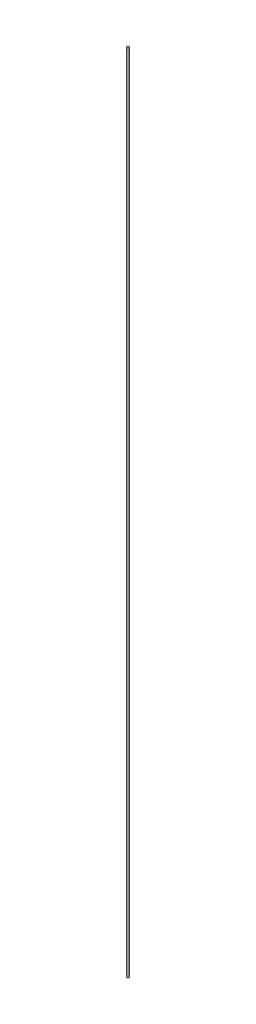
from build123d import *

# Parameters (mm, degrees)
ESQUISSE1_R      = 1.5
EXTRUSION1_DEPTH = 1071


with BuildPart() as part:
    # Esquisse1 → Extrusion1 (new body)
    with BuildSketch(Plane(origin=(0, 0, 0), x_dir=(1, 0, 0), z_dir=(0, 1, 0))):
        with Locations(Location((0, 0, 0), (0, 0, 270))):
            Circle(ESQUISSE1_R)
    extrude(amount=EXTRUSION1_DEPTH)


solid = part.part
